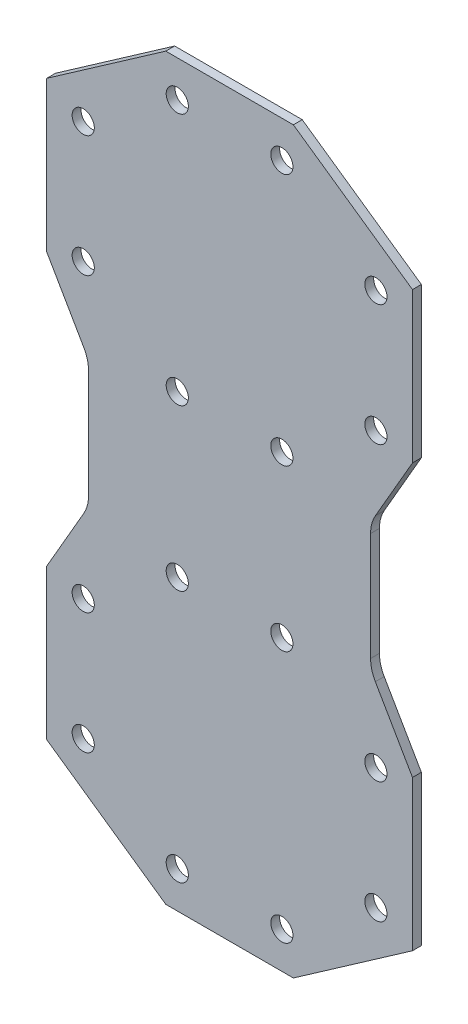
from build123d import *

# Parameters (mm, degrees)
MAIN_PLATE_DEPTH   = 25.4
SKETCH5_R          = 31.75
CUT_EXTRUDE1_DEPTH = 25.4


with BuildPart() as part:
    # Sketch3 → Main Plate (new body)
    with BuildSketch(Plane(origin=(0, 0, 0), x_dir=(0, 1, 0), z_dir=(0, 0, 1))):
        with BuildLine():
            Line((201.663107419, -523.855268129), (-228.234235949, -523.855268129))
            Line((-228.234235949, -523.855268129), (-466.324268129, -182.70492307))
            Line((-466.324268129, -182.70492307), (-466.324268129, 182.70492307))
            Line((-466.324268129, 182.70492307), (-228.234235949, 523.855268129))
            Line((-228.234235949, 523.855268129), (201.663107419, 523.855268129))
            Line((201.663107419, 523.855268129), (385.932842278, 417.467087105))
            ThreePointArc((385.932842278, 417.467087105), (410.436827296, 407.317204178), (436.732842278, 403.855268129))
            Line((436.732842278, 403.855268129), (746.653157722, 403.855268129))
            ThreePointArc((746.653157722, 403.855268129), (772.949172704, 407.317204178), (797.453157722, 417.467087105))
            Line((797.453157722, 417.467087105), (981.722892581, 523.855268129))
            Line((981.722892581, 523.855268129), (1411.620235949, 523.855268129))
            Line((1411.620235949, 523.855268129), (1649.710268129, 182.70492307))
            Line((1649.710268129, 182.70492307), (1649.710268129, -182.70492307))
            Line((1649.710268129, -182.70492307), (1411.620235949, -523.855268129))
            Line((1411.620235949, -523.855268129), (981.722892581, -523.855268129))
            Line((981.722892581, -523.855268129), (797.453157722, -417.467087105))
            ThreePointArc((797.453157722, -417.467087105), (772.949172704, -407.317204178), (746.653157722, -403.855268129))
            Line((746.653157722, -403.855268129), (436.732842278, -403.855268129))
            ThreePointArc((436.732842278, -403.855268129), (410.436827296, -407.317204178), (385.932842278, -417.467087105))
            Line((385.932842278, -417.467087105), (201.663107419, -523.855268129))
        make_face()
    extrude(amount=MAIN_PLATE_DEPTH)

    # Sketch5 → Cut-Extrude1 (cut)
    with BuildSketch(Plane(origin=(0, 0, 0), x_dir=(0, 1, 0), z_dir=(0, 0, 1))):
        with Locations(Location((-173.588730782, 419.080268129, 0), (0, 0, 270))):
            Circle(SKETCH5_R)
        with Locations(Location((173.588730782, 419.080268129, 0), (0, 0, 270))):
            Circle(SKETCH5_R)
        with Locations(Location((361.549268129, 149.758610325, 0), (0, 0, 270))):
            Circle(SKETCH5_R)
        with Locations(Location((361.549268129, -149.758610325, 0), (0, 0, 270))):
            Circle(SKETCH5_R)
        with Locations(Location((173.588730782, -419.080268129, 0), (0, 0, 270))):
            Circle(SKETCH5_R)
        with Locations(Location((-173.588730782, -419.080268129, 0), (0, 0, 270))):
            Circle(SKETCH5_R)
        with Locations(Location((-361.549268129, -149.758610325, 0), (0, 0, 270))):
            Circle(SKETCH5_R)
        with Locations(Location((-361.549268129, 149.758610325, 0), (0, 0, 270))):
            Circle(SKETCH5_R)
        with Locations(Location((1544.935268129, 149.758610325, 0), (0, 0, 270))):
            Circle(SKETCH5_R)
        with Locations(Location((1544.935268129, -149.758610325, 0), (0, 0, 270))):
            Circle(SKETCH5_R)
        with Locations(Location((1009.797269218, 419.080268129, 0), (0, 0, 270))):
            Circle(SKETCH5_R)
        with Locations(Location((821.836731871, -149.758610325, 0), (0, 0, 270))):
            Circle(SKETCH5_R)
        with Locations(Location((821.836731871, 149.758610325, 0), (0, 0, 270))):
            Circle(SKETCH5_R)
        with Locations(Location((1356.974730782, 419.080268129, 0), (0, 0, 270))):
            Circle(SKETCH5_R)
        with Locations(Location((1356.974730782, -419.080268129, 0), (0, 0, 270))):
            Circle(SKETCH5_R)
        with Locations(Location((1009.797269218, -419.080268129, 0), (0, 0, 270))):
            Circle(SKETCH5_R)
    extrude(amount=CUT_EXTRUDE1_DEPTH, mode=Mode.SUBTRACT)


solid = part.part
